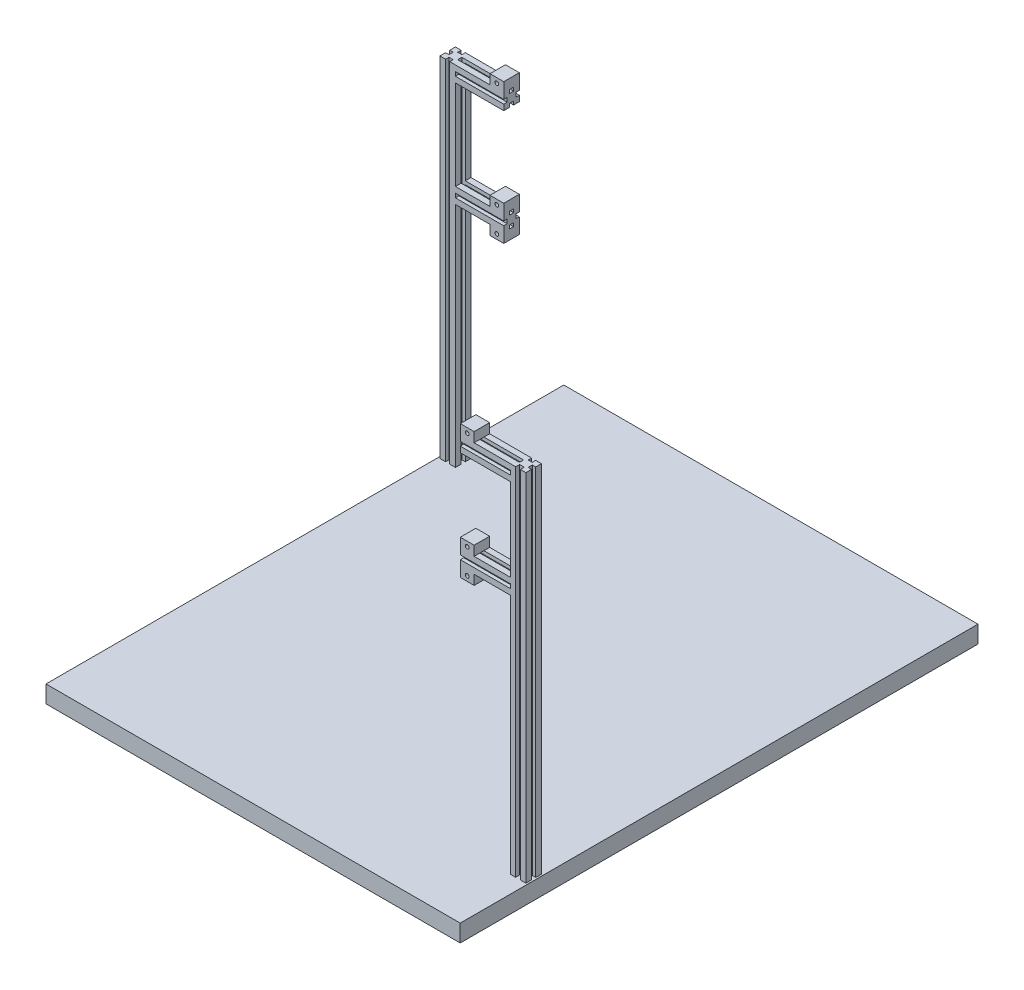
from build123d import *

# Parameters (mm, degrees)
SCHIZZO1_W                    = 1200
SCHIZZO1_H                    = 1500
ESTRUSIONE_ESTRUSIONE1_DEPTH  = 50
ESTRUSIONE_ESTRUSIONE2_DEPTH  = 705
ESTRUSIONE_ESTRUSIONE3_DEPTH  = 140
ESTRUSIONE_ESTRUSIONE4_DEPTH  = 305
ESTRUSIONE_ESTRUSIONE5_DEPTH  = 745
ESTRUSIONE_ESTRUSIONE6_DEPTH  = 145
ESTRUSIONE_ESTRUSIONE7_DEPTH  = 285
SCHIZZO7_W                    = 40
SCHIZZO7_H                    = 45
ESTRUSIONE_ESTRUSIONE8_DEPTH  = 28
SCHIZZO8_R                    = 5.5
TAGLIO_ESTRUSIONE1_DEPTH      = 45
SCHIZZO9_W                    = 40
SCHIZZO9_H                    = 45
ESTRUSIONE_ESTRUSIONE9_DEPTH  = 28
SCHIZZO10_R                   = 5.5
TAGLIO_ESTRUSIONE2_DEPTH      = 45
SCHIZZO11_W                   = 40
SCHIZZO11_H                   = 45
ESTRUSIONE_ESTRUSIONE10_DEPTH = 28
SCHIZZO12_R                   = 5.5
TAGLIO_ESTRUSIONE3_DEPTH      = 45
SCHIZZO13_W                   = 40
SCHIZZO13_H                   = 45
ESTRUSIONE_ESTRUSIONE11_DEPTH = 28
SCHIZZO14_R                   = 5.5
TAGLIO_ESTRUSIONE4_DEPTH      = 45
ESTRUSIONE_ESTRUSIONE12_DEPTH = 140
SCHIZZO16_W                   = 40
SCHIZZO16_H                   = 45
ESTRUSIONE_ESTRUSIONE13_DEPTH = 28
SCHIZZO17_R                   = 5.5
TAGLIO_ESTRUSIONE5_DEPTH      = 45
ESTRUSIONE_ESTRUSIONE14_DEPTH = 145
SCHIZZO19_W                   = 40
SCHIZZO19_H                   = 45
ESTRUSIONE_ESTRUSIONE15_DEPTH = 28
SCHIZZO20_R                   = 5.5
TAGLIO_ESTRUSIONE6_DEPTH      = 45


with BuildPart() as part:
    # Schizzo1 → Estrusione-Estrusione1 (new body)
    with BuildSketch(Plane(origin=(0, 0, 0), x_dir=(1, 0, 0), z_dir=(0, 1, 0))):
        Rectangle(SCHIZZO1_W, SCHIZZO1_H)
    extrude(amount=ESTRUSIONE_ESTRUSIONE1_DEPTH)

    # Schizzo2 → Estrusione-Estrusione2 (add)
    with BuildSketch(Plane(origin=(0, 50, 0), x_dir=(1, 0, 0), z_dir=(0, 1, 0))):
        Polygon((-578.5, 431.114054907), (-595, 431.114054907), (-595, 414.614054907), (-585, 414.614054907), (-585, 402.614054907), (-595, 402.614054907), (-595, 386.114054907), (-578.5, 386.114054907), (-578.5, 396.114054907), (-566.5, 396.114054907), (-566.5, 386.114054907), (-550, 386.114054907), (-550, 402.614054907), (-560, 402.614054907), (-560, 414.614054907), (-550, 414.614054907), (-550, 431.114054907), (-566.5, 431.114054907), (-566.5, 421.114054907), (-578.5, 421.114054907), align=None)
    extrude(amount=ESTRUSIONE_ESTRUSIONE2_DEPTH)

    # Schizzo3 → Estrusione-Estrusione3 (add)
    with BuildSketch(Plane(origin=(-550, 0, 0), x_dir=(0, 0, -1), z_dir=(1, 0, 0))):
        Polygon((402.614054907, 755), (386.114054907, 755), (386.114054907, 738.5), (396.114054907, 738.5), (396.114054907, 726.5), (386.114054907, 726.5), (386.114054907, 710), (402.614054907, 710), (402.614054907, 720), (402.614054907, 745), align=None)
        Polygon((431.114054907, 755), (414.614054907, 755), (414.614054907, 745), (402.614054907, 745), (402.614054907, 720), (414.614054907, 720), (414.614054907, 710), (431.114054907, 710), (431.114054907, 726.5), (421.114054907, 726.5), (421.114054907, 738.5), (431.114054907, 738.5), align=None)
    extrude(amount=ESTRUSIONE_ESTRUSIONE3_DEPTH)

    # Schizzo4 → Estrusione-Estrusione4 (add)
    with BuildSketch(Plane(origin=(0, 755, 0), x_dir=(1, 0, 0), z_dir=(0, 1, 0))):
        Polygon((-578.5, 431.114054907), (-595, 431.114054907), (-595, 414.614054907), (-585, 414.614054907), (-585, 402.614054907), (-595, 402.614054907), (-595, 386.114054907), (-578.5, 386.114054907), (-578.5, 396.114054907), (-566.5, 396.114054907), (-566.5, 386.114054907), (-550, 386.114054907), (-550, 402.614054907), (-560, 402.614054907), (-560, 414.614054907), (-550, 414.614054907), (-550, 431.114054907), (-566.5, 431.114054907), (-566.5, 421.114054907), (-578.5, 421.114054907), align=None)
    extrude(amount=ESTRUSIONE_ESTRUSIONE4_DEPTH)

    # Schizzo2_3 → Estrusione-Estrusione5 (add)
    with BuildSketch(Plane(origin=(0, 50, 0), x_dir=(1, 0, 0), z_dir=(0, 1, 0))):
        Polygon((566.5, -509.753752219), (550, -509.753752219), (550, -526.253752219), (560, -526.253752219), (560, -538.253752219), (550, -538.253752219), (550, -554.753752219), (565.423232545, -554.753752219), (565.423232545, -543.351967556), (579.052338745, -543.351967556), (579.052338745, -554.753752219), (595, -554.753752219), (595, -538.253752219), (585, -538.253752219), (585, -526.253752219), (595, -526.253752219), (595, -509.753752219), (578.5, -509.753752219), (578.5, -519.753752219), (566.5, -519.753752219), align=None)
    extrude(amount=ESTRUSIONE_ESTRUSIONE5_DEPTH)

    # Schizzo5 → Estrusione-Estrusione6 (add)
    with BuildSketch(Plane.ZY.offset(-550)):
        Polygon((526.253752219, 795), (509.753752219, 795), (509.753752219, 778.631017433), (519.753752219, 778.631017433), (519.753752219, 766.631017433), (509.753752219, 766.631017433), (509.753752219, 750), (526.253752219, 750), (526.253752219, 760), (526.253752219, 785), align=None)
        Polygon((554.753752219, 795), (538.253752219, 795), (538.253752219, 785), (526.253752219, 785), (526.253752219, 760), (538.253752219, 760), (538.253752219, 750), (554.753752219, 750), (554.753752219, 766.631017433), (544.753752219, 766.631017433), (544.753752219, 778.631017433), (554.753752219, 778.631017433), align=None)
    extrude(amount=ESTRUSIONE_ESTRUSIONE6_DEPTH)

    # Schizzo6 → Estrusione-Estrusione7 (add)
    with BuildSketch(Plane(origin=(0, 795, 0), x_dir=(1, 0, 0), z_dir=(0, 1, 0))):
        Polygon((595, -526.253752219), (595, -509.753752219), (578.5, -509.753752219), (578.5, -519.753752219), (566.5, -519.753752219), (566.5, -509.753752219), (550, -509.753752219), (550, -526.253752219), (560, -526.253752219), (560, -538.253752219), (550, -538.253752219), (550, -554.753752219), (565.423232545, -554.753752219), (565.423232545, -543.351967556), (579.052338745, -543.351967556), (579.052338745, -554.753752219), (595, -554.753752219), (595, -538.253752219), (585, -538.253752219), (585, -526.253752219), align=None)
    extrude(amount=ESTRUSIONE_ESTRUSIONE7_DEPTH)

    # Schizzo7 → Estrusione-Estrusione8 (add)
    with BuildSketch(Plane(origin=(0, 755, 0), x_dir=(1, 0, 0), z_dir=(0, 1, 0))):
        with Locations((-430, 408.614054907)):
            Rectangle(SCHIZZO7_W, SCHIZZO7_H)
    extrude(amount=ESTRUSIONE_ESTRUSIONE8_DEPTH)

    # Schizzo8 → Taglio-Estrusione1 (cut)
    with BuildSketch(Plane.XY.offset(-386.114054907)):
        with Locations((-430, 769)):
            Circle(SCHIZZO8_R)
    extrude(amount=-TAGLIO_ESTRUSIONE1_DEPTH, mode=Mode.SUBTRACT)

    # Schizzo9 → Estrusione-Estrusione9 (add)
    with BuildSketch(Plane.XZ.offset(-710)):
        with Locations((-430, -408.614054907)):
            Rectangle(SCHIZZO9_W, SCHIZZO9_H)
    extrude(amount=ESTRUSIONE_ESTRUSIONE9_DEPTH)

    # Schizzo10 → Taglio-Estrusione2 (cut)
    with BuildSketch(Plane.XY.offset(-386.114054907)):
        with Locations((-430, 696)):
            Circle(SCHIZZO10_R)
    extrude(amount=-TAGLIO_ESTRUSIONE2_DEPTH, mode=Mode.SUBTRACT)

    # Schizzo11 → Estrusione-Estrusione10 (add)
    with BuildSketch(Plane(origin=(0, 795, 0), x_dir=(1, 0, 0), z_dir=(0, 1, 0))):
        with Locations((425, -532.253752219)):
            Rectangle(SCHIZZO11_W, SCHIZZO11_H)
    extrude(amount=ESTRUSIONE_ESTRUSIONE10_DEPTH)

    # Schizzo12 → Taglio-Estrusione3 (cut)
    with BuildSketch(Plane.XY.offset(554.753752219)):
        with Locations((425, 809)):
            Circle(SCHIZZO12_R)
    extrude(amount=-TAGLIO_ESTRUSIONE3_DEPTH, mode=Mode.SUBTRACT)

    # Schizzo13 → Estrusione-Estrusione11 (add)
    with BuildSketch(Plane.XZ.offset(-750)):
        with Locations((425, 532.253752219)):
            Rectangle(SCHIZZO13_W, SCHIZZO13_H)
    extrude(amount=ESTRUSIONE_ESTRUSIONE11_DEPTH)

    # Schizzo14 → Taglio-Estrusione4 (cut)
    with BuildSketch(Plane.XY.offset(554.753752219)):
        with Locations((425, 736)):
            Circle(SCHIZZO14_R)
    extrude(amount=-TAGLIO_ESTRUSIONE4_DEPTH, mode=Mode.SUBTRACT)

    # Schizzo15 → Estrusione-Estrusione12 (add)
    with BuildSketch(Plane(origin=(-550, 0, 0), x_dir=(0, 0, -1), z_dir=(1, 0, 0))):
        Polygon((431.114054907, 1060), (414.614054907, 1060), (414.614054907, 1050), (402.614054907, 1050), (402.614054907, 1025), (414.614054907, 1025), (414.614054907, 1015), (431.114054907, 1015), (431.114054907, 1031.5), (421.114054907, 1031.5), (421.114054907, 1043.5), (431.114054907, 1043.5), align=None)
        Polygon((402.614054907, 1060), (386.114054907, 1060), (386.114054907, 1043.5), (396.114054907, 1043.5), (396.114054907, 1031.5), (386.114054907, 1031.5), (386.114054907, 1015), (402.614054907, 1015), (402.614054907, 1025), (402.614054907, 1050), align=None)
    extrude(amount=ESTRUSIONE_ESTRUSIONE12_DEPTH)

    # Schizzo16 → Estrusione-Estrusione13 (add)
    with BuildSketch(Plane(origin=(0, 1060, 0), x_dir=(1, 0, 0), z_dir=(0, 1, 0))):
        with Locations((-430, 408.614054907)):
            Rectangle(SCHIZZO16_W, SCHIZZO16_H)
    extrude(amount=ESTRUSIONE_ESTRUSIONE13_DEPTH)

    # Schizzo17 → Taglio-Estrusione5 (cut)
    with BuildSketch(Plane.XY.offset(-386.114054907)):
        with Locations((-430, 1074)):
            Circle(SCHIZZO17_R)
    extrude(amount=-TAGLIO_ESTRUSIONE5_DEPTH, mode=Mode.SUBTRACT)

    # Schizzo18 → Estrusione-Estrusione14 (add)
    with BuildSketch(Plane.ZY.offset(-550)):
        Polygon((526.253752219, 1070), (526.253752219, 1080), (509.753752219, 1080), (509.753752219, 1063.5), (519.753752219, 1063.5), (519.753752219, 1051.5), (509.753752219, 1051.5), (509.753752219, 1035), (526.253752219, 1035), (526.253752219, 1045), (538.253752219, 1045), (538.253752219, 1070), align=None)
        Polygon((554.753752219, 1063.5), (554.753752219, 1080), (538.253752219, 1080), (538.253752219, 1070), (538.253752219, 1045), (538.253752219, 1035), (554.753752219, 1035), (554.753752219, 1051.5), (544.753752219, 1051.5), (544.753752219, 1063.5), align=None)
    extrude(amount=ESTRUSIONE_ESTRUSIONE14_DEPTH)

    # Schizzo19 → Estrusione-Estrusione15 (add)
    with BuildSketch(Plane(origin=(0, 1080, 0), x_dir=(1, 0, 0), z_dir=(0, 1, 0))):
        with Locations((425, -532.253752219)):
            Rectangle(SCHIZZO19_W, SCHIZZO19_H)
    extrude(amount=ESTRUSIONE_ESTRUSIONE15_DEPTH)

    # Schizzo20 → Taglio-Estrusione6 (cut)
    with BuildSketch(Plane.XY.offset(554.753752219)):
        with Locations((425, 1094)):
            Circle(SCHIZZO20_R)
    extrude(amount=-TAGLIO_ESTRUSIONE6_DEPTH, mode=Mode.SUBTRACT)


solid = part.part
